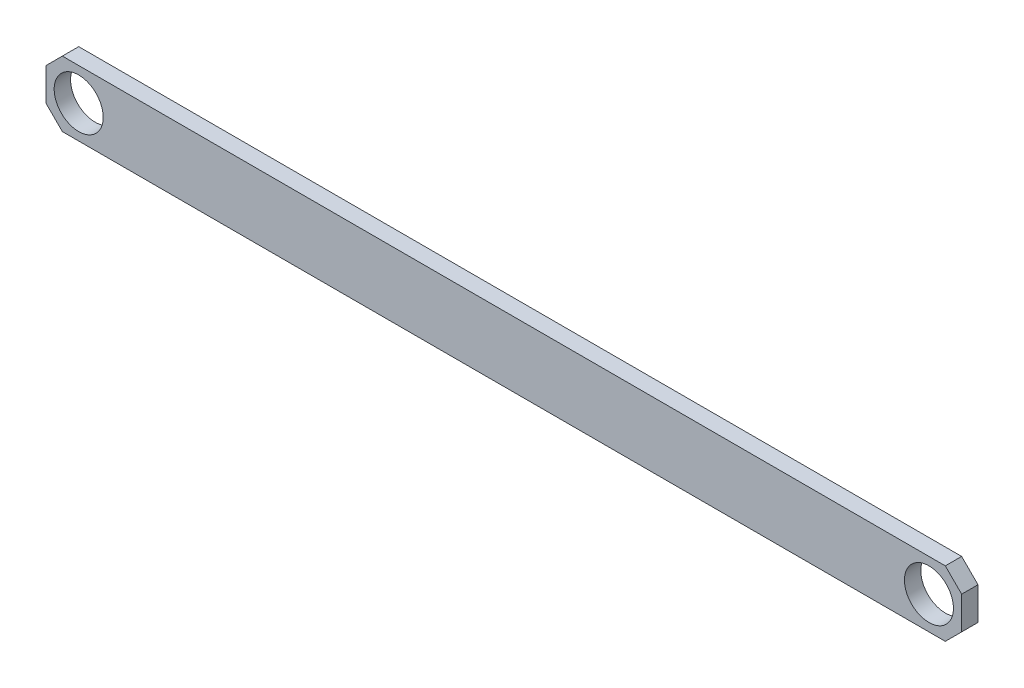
ISO-10303-21;
HEADER;
FILE_DESCRIPTION(('STEP AP214'),'2;1');
FILE_NAME('part.step','',(''),(''),'','','');
FILE_SCHEMA(('AUTOMOTIVE_DESIGN { 1 0 10303 214 1 1 1 1 }'));
ENDSEC;
DATA;
#1=APPLICATION_CONTEXT('core data for automotive mechanical design processes');
#2=APPLICATION_PROTOCOL_DEFINITION('international standard','automotive_design',2000,#1);
#3=PRODUCT_CONTEXT('',#1,'mechanical');
#4=PRODUCT('Part','Part','',(#3));
#5=PRODUCT_RELATED_PRODUCT_CATEGORY('part','',(#4));
#6=PRODUCT_DEFINITION_FORMATION('','',#4);
#7=PRODUCT_DEFINITION_CONTEXT('part definition',#1,'design');
#8=PRODUCT_DEFINITION('design','',#6,#7);
#9=PRODUCT_DEFINITION_SHAPE('','',#8);
#10=(LENGTH_UNIT() NAMED_UNIT(*) SI_UNIT(.MILLI.,.METRE.));
#11=(NAMED_UNIT(*) PLANE_ANGLE_UNIT() SI_UNIT($,.RADIAN.));
#12=(NAMED_UNIT(*) SI_UNIT($,.STERADIAN.) SOLID_ANGLE_UNIT());
#13=UNCERTAINTY_MEASURE_WITH_UNIT(LENGTH_MEASURE(1.E-05),#10,'distance_accuracy_value','');
#14=(GEOMETRIC_REPRESENTATION_CONTEXT(3) GLOBAL_UNCERTAINTY_ASSIGNED_CONTEXT((#13)) GLOBAL_UNIT_ASSIGNED_CONTEXT((#10,
#11,#12)) REPRESENTATION_CONTEXT('',''));
#15=CARTESIAN_POINT('',(0.,0.,0.));
#16=DIRECTION('',(0.,0.,1.));
#17=DIRECTION('',(1.,0.,0.));
#18=AXIS2_PLACEMENT_3D('',#15,#16,#17);
#19=CARTESIAN_POINT('',(0.,12.7,3.175));
#20=DIRECTION('',(0.,0.,-1.));
#21=DIRECTION('',(-1.,0.,0.));
#22=AXIS2_PLACEMENT_3D('',#19,#20,#21);
#23=PLANE('',#22);
#24=CARTESIAN_POINT('',(6.35,6.35,3.175));
#25=DIRECTION('',(0.,0.,1.));
#26=DIRECTION('',(1.,0.,0.));
#27=AXIS2_PLACEMENT_3D('',#24,#25,#26);
#28=CIRCLE('',#27,4.7625);
#29=CARTESIAN_POINT('',(11.1125,6.35,3.175));
#30=VERTEX_POINT('',#29);
#31=EDGE_CURVE('E125',#30,#30,#28,.T.);
#32=ORIENTED_EDGE('',*,*,#31,.F.);
#33=EDGE_LOOP('',(#32));
#34=FACE_BOUND('',#33,.T.);
#35=DIRECTION('',(-1.,0.,0.));
#36=VECTOR('',#35,1.);
#37=CARTESIAN_POINT('',(0.,12.7,3.175));
#38=LINE('',#37,#36);
#39=CARTESIAN_POINT('',(174.625,12.7,3.175));
#40=VERTEX_POINT('',#39);
#41=CARTESIAN_POINT('',(3.17500000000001,12.7,3.175));
#42=VERTEX_POINT('',#41);
#43=EDGE_CURVE('E143',#40,#42,#38,.T.);
#44=ORIENTED_EDGE('',*,*,#43,.T.);
#45=DIRECTION('',(0.707106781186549,0.707106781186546,0.));
#46=VECTOR('',#45,1.);
#47=CARTESIAN_POINT('',(0.,9.525,3.175));
#48=LINE('',#47,#46);
#49=CARTESIAN_POINT('',(0.,9.525,3.175));
#50=VERTEX_POINT('',#49);
#51=EDGE_CURVE('E159',#42,#50,#48,.F.);
#52=ORIENTED_EDGE('',*,*,#51,.T.);
#53=DIRECTION('',(0.,-1.,0.));
#54=VECTOR('',#53,1.);
#55=CARTESIAN_POINT('',(0.,0.,3.175));
#56=LINE('',#55,#54);
#57=CARTESIAN_POINT('',(0.,3.17500000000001,3.175));
#58=VERTEX_POINT('',#57);
#59=EDGE_CURVE('E117',#50,#58,#56,.T.);
#60=ORIENTED_EDGE('',*,*,#59,.T.);
#61=DIRECTION('',(-0.707106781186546,0.707106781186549,0.));
#62=VECTOR('',#61,1.);
#63=CARTESIAN_POINT('',(3.175,0.,3.175));
#64=LINE('',#63,#62);
#65=CARTESIAN_POINT('',(3.175,0.,3.175));
#66=VERTEX_POINT('',#65);
#67=EDGE_CURVE('E157',#58,#66,#64,.F.);
#68=ORIENTED_EDGE('',*,*,#67,.T.);
#69=DIRECTION('',(1.,0.,0.));
#70=VECTOR('',#69,1.);
#71=CARTESIAN_POINT('',(0.,0.,3.175));
#72=LINE('',#71,#70);
#73=CARTESIAN_POINT('',(174.625,0.,3.175));
#74=VERTEX_POINT('',#73);
#75=EDGE_CURVE('E139',#66,#74,#72,.T.);
#76=ORIENTED_EDGE('',*,*,#75,.T.);
#77=DIRECTION('',(-0.707106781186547,-0.707106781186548,0.));
#78=VECTOR('',#77,1.);
#79=CARTESIAN_POINT('',(177.8,3.17500000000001,3.175));
#80=LINE('',#79,#78);
#81=CARTESIAN_POINT('',(177.8,3.17500000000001,3.175));
#82=VERTEX_POINT('',#81);
#83=EDGE_CURVE('E53',#74,#82,#80,.F.);
#84=ORIENTED_EDGE('',*,*,#83,.T.);
#85=DIRECTION('',(0.,1.,0.));
#86=VECTOR('',#85,1.);
#87=CARTESIAN_POINT('',(177.8,0.,3.175));
#88=LINE('',#87,#86);
#89=CARTESIAN_POINT('',(177.8,9.525,3.175));
#90=VERTEX_POINT('',#89);
#91=EDGE_CURVE('E141',#82,#90,#88,.T.);
#92=ORIENTED_EDGE('',*,*,#91,.T.);
#93=DIRECTION('',(0.707106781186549,-0.707106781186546,0.));
#94=VECTOR('',#93,1.);
#95=CARTESIAN_POINT('',(174.625,12.7,3.175));
#96=LINE('',#95,#94);
#97=EDGE_CURVE('E154',#90,#40,#96,.F.);
#98=ORIENTED_EDGE('',*,*,#97,.T.);
#99=EDGE_LOOP('',(#44,#52,#60,#68,#76,#84,#92,#98));
#100=FACE_BOUND('',#99,.T.);
#101=CARTESIAN_POINT('',(171.45,6.35,3.175));
#102=DIRECTION('',(0.,0.,1.));
#103=DIRECTION('',(-1.,0.,0.));
#104=AXIS2_PLACEMENT_3D('',#101,#102,#103);
#105=CIRCLE('',#104,4.76249999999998);
#106=CARTESIAN_POINT('',(166.6875,6.35,3.175));
#107=VERTEX_POINT('',#106);
#108=EDGE_CURVE('E290',#107,#107,#105,.T.);
#109=ORIENTED_EDGE('',*,*,#108,.F.);
#110=EDGE_LOOP('',(#109));
#111=FACE_BOUND('',#110,.T.);
#112=ADVANCED_FACE('F32',(#34,#100,#111),#23,.F.);
#113=CARTESIAN_POINT('',(0.,12.7,0.));
#114=DIRECTION('',(0.,0.,-1.));
#115=DIRECTION('',(-1.,0.,0.));
#116=AXIS2_PLACEMENT_3D('',#113,#114,#115);
#117=PLANE('',#116);
#118=CARTESIAN_POINT('',(6.35,6.35,0.));
#119=DIRECTION('',(0.,0.,1.));
#120=DIRECTION('',(1.,0.,0.));
#121=AXIS2_PLACEMENT_3D('',#118,#119,#120);
#122=CIRCLE('',#121,4.7625);
#123=CARTESIAN_POINT('',(11.1125,6.35,0.));
#124=VERTEX_POINT('',#123);
#125=EDGE_CURVE('E131',#124,#124,#122,.T.);
#126=ORIENTED_EDGE('',*,*,#125,.T.);
#127=EDGE_LOOP('',(#126));
#128=FACE_BOUND('',#127,.T.);
#129=DIRECTION('',(0.,-1.,0.));
#130=VECTOR('',#129,1.);
#131=CARTESIAN_POINT('',(0.,0.,0.));
#132=LINE('',#131,#130);
#133=CARTESIAN_POINT('',(0.,9.525,0.));
#134=VERTEX_POINT('',#133);
#135=CARTESIAN_POINT('',(0.,3.17500000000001,0.));
#136=VERTEX_POINT('',#135);
#137=EDGE_CURVE('E114',#134,#136,#132,.T.);
#138=ORIENTED_EDGE('',*,*,#137,.F.);
#139=DIRECTION('',(-0.707106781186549,-0.707106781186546,0.));
#140=VECTOR('',#139,1.);
#141=CARTESIAN_POINT('',(1.5875,11.1125,0.));
#142=LINE('',#141,#140);
#143=CARTESIAN_POINT('',(3.17500000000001,12.7,0.));
#144=VERTEX_POINT('',#143);
#145=EDGE_CURVE('E98',#134,#144,#142,.F.);
#146=ORIENTED_EDGE('',*,*,#145,.T.);
#147=DIRECTION('',(-1.,0.,0.));
#148=VECTOR('',#147,1.);
#149=CARTESIAN_POINT('',(0.,12.7,0.));
#150=LINE('',#149,#148);
#151=CARTESIAN_POINT('',(174.625,12.7,0.));
#152=VERTEX_POINT('',#151);
#153=EDGE_CURVE('E136',#152,#144,#150,.T.);
#154=ORIENTED_EDGE('',*,*,#153,.F.);
#155=DIRECTION('',(-0.707106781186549,0.707106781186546,0.));
#156=VECTOR('',#155,1.);
#157=CARTESIAN_POINT('',(87.3124999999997,100.0125,0.));
#158=LINE('',#157,#156);
#159=CARTESIAN_POINT('',(177.8,9.525,0.));
#160=VERTEX_POINT('',#159);
#161=EDGE_CURVE('E118',#152,#160,#158,.F.);
#162=ORIENTED_EDGE('',*,*,#161,.T.);
#163=DIRECTION('',(0.,1.,0.));
#164=VECTOR('',#163,1.);
#165=CARTESIAN_POINT('',(177.8,0.,0.));
#166=LINE('',#165,#164);
#167=CARTESIAN_POINT('',(177.8,3.17500000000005,0.));
#168=VERTEX_POINT('',#167);
#169=EDGE_CURVE('E128',#168,#160,#166,.T.);
#170=ORIENTED_EDGE('',*,*,#169,.F.);
#171=DIRECTION('',(0.707106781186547,0.707106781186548,0.));
#172=VECTOR('',#171,1.);
#173=CARTESIAN_POINT('',(93.6625,-80.9625,0.));
#174=LINE('',#173,#172);
#175=CARTESIAN_POINT('',(174.625,0.,0.));
#176=VERTEX_POINT('',#175);
#177=EDGE_CURVE('E148',#168,#176,#174,.F.);
#178=ORIENTED_EDGE('',*,*,#177,.T.);
#179=DIRECTION('',(1.,0.,0.));
#180=VECTOR('',#179,1.);
#181=CARTESIAN_POINT('',(0.,0.,0.));
#182=LINE('',#181,#180);
#183=CARTESIAN_POINT('',(3.175,0.,0.));
#184=VERTEX_POINT('',#183);
#185=EDGE_CURVE('E124',#184,#176,#182,.T.);
#186=ORIENTED_EDGE('',*,*,#185,.F.);
#187=DIRECTION('',(0.707106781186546,-0.707106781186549,0.));
#188=VECTOR('',#187,1.);
#189=CARTESIAN_POINT('',(-4.76249999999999,7.93750000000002,0.));
#190=LINE('',#189,#188);
#191=EDGE_CURVE('E109',#184,#136,#190,.F.);
#192=ORIENTED_EDGE('',*,*,#191,.T.);
#193=EDGE_LOOP('',(#138,#146,#154,#162,#170,#178,#186,#192));
#194=FACE_BOUND('',#193,.T.);
#195=CARTESIAN_POINT('',(171.45,6.35,0.));
#196=DIRECTION('',(0.,0.,1.));
#197=DIRECTION('',(-1.,0.,0.));
#198=AXIS2_PLACEMENT_3D('',#195,#196,#197);
#199=CIRCLE('',#198,4.76249999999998);
#200=CARTESIAN_POINT('',(166.6875,6.35,0.));
#201=VERTEX_POINT('',#200);
#202=EDGE_CURVE('E292',#201,#201,#199,.T.);
#203=ORIENTED_EDGE('',*,*,#202,.T.);
#204=EDGE_LOOP('',(#203));
#205=FACE_BOUND('',#204,.T.);
#206=ADVANCED_FACE('F121',(#128,#194,#205),#117,.T.);
#207=CARTESIAN_POINT('',(0.,0.,3.175));
#208=DIRECTION('',(1.,0.,0.));
#209=DIRECTION('',(0.,0.,-1.));
#210=AXIS2_PLACEMENT_3D('',#207,#208,#209);
#211=PLANE('',#210);
#212=ORIENTED_EDGE('',*,*,#59,.F.);
#213=DIRECTION('',(0.,0.,-1.));
#214=VECTOR('',#213,1.);
#215=CARTESIAN_POINT('',(0.,9.525,3.175));
#216=LINE('',#215,#214);
#217=EDGE_CURVE('E102',#50,#134,#216,.T.);
#218=ORIENTED_EDGE('',*,*,#217,.T.);
#219=ORIENTED_EDGE('',*,*,#137,.T.);
#220=DIRECTION('',(0.,0.,1.));
#221=VECTOR('',#220,1.);
#222=CARTESIAN_POINT('',(0.,3.17500000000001,3.175));
#223=LINE('',#222,#221);
#224=EDGE_CURVE('E119',#136,#58,#223,.T.);
#225=ORIENTED_EDGE('',*,*,#224,.T.);
#226=EDGE_LOOP('',(#212,#218,#219,#225));
#227=FACE_BOUND('',#226,.T.);
#228=ADVANCED_FACE('F34',(#227),#211,.F.);
#229=CARTESIAN_POINT('',(0.,0.,3.175));
#230=DIRECTION('',(0.,1.,0.));
#231=DIRECTION('',(0.,0.,1.));
#232=AXIS2_PLACEMENT_3D('',#229,#230,#231);
#233=PLANE('',#232);
#234=ORIENTED_EDGE('',*,*,#75,.F.);
#235=DIRECTION('',(0.,0.,-1.));
#236=VECTOR('',#235,1.);
#237=CARTESIAN_POINT('',(3.175,0.,3.175));
#238=LINE('',#237,#236);
#239=EDGE_CURVE('E163',#66,#184,#238,.T.);
#240=ORIENTED_EDGE('',*,*,#239,.T.);
#241=ORIENTED_EDGE('',*,*,#185,.T.);
#242=DIRECTION('',(0.,0.,1.));
#243=VECTOR('',#242,1.);
#244=CARTESIAN_POINT('',(174.625,0.,3.175));
#245=LINE('',#244,#243);
#246=EDGE_CURVE('E161',#176,#74,#245,.T.);
#247=ORIENTED_EDGE('',*,*,#246,.T.);
#248=EDGE_LOOP('',(#234,#240,#241,#247));
#249=FACE_BOUND('',#248,.T.);
#250=ADVANCED_FACE('F168',(#249),#233,.F.);
#251=CARTESIAN_POINT('',(177.8,0.,3.175));
#252=DIRECTION('',(-1.,0.,0.));
#253=DIRECTION('',(0.,0.,1.));
#254=AXIS2_PLACEMENT_3D('',#251,#252,#253);
#255=PLANE('',#254);
#256=ORIENTED_EDGE('',*,*,#91,.F.);
#257=DIRECTION('',(0.,0.,-1.));
#258=VECTOR('',#257,1.);
#259=CARTESIAN_POINT('',(177.8,3.17500000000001,3.175));
#260=LINE('',#259,#258);
#261=EDGE_CURVE('E11',#82,#168,#260,.T.);
#262=ORIENTED_EDGE('',*,*,#261,.T.);
#263=ORIENTED_EDGE('',*,*,#169,.T.);
#264=DIRECTION('',(0.,0.,1.));
#265=VECTOR('',#264,1.);
#266=CARTESIAN_POINT('',(177.8,9.525,3.175));
#267=LINE('',#266,#265);
#268=EDGE_CURVE('E40',#160,#90,#267,.T.);
#269=ORIENTED_EDGE('',*,*,#268,.T.);
#270=EDGE_LOOP('',(#256,#262,#263,#269));
#271=FACE_BOUND('',#270,.T.);
#272=ADVANCED_FACE('F176',(#271),#255,.F.);
#273=CARTESIAN_POINT('',(0.,12.7,3.175));
#274=DIRECTION('',(0.,-1.,0.));
#275=DIRECTION('',(0.,0.,-1.));
#276=AXIS2_PLACEMENT_3D('',#273,#274,#275);
#277=PLANE('',#276);
#278=ORIENTED_EDGE('',*,*,#153,.T.);
#279=DIRECTION('',(0.,0.,1.));
#280=VECTOR('',#279,1.);
#281=CARTESIAN_POINT('',(3.17500000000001,12.7,3.175));
#282=LINE('',#281,#280);
#283=EDGE_CURVE('E103',#144,#42,#282,.T.);
#284=ORIENTED_EDGE('',*,*,#283,.T.);
#285=ORIENTED_EDGE('',*,*,#43,.F.);
#286=DIRECTION('',(0.,0.,-1.));
#287=VECTOR('',#286,1.);
#288=CARTESIAN_POINT('',(174.625,12.7,3.175));
#289=LINE('',#288,#287);
#290=EDGE_CURVE('E108',#40,#152,#289,.T.);
#291=ORIENTED_EDGE('',*,*,#290,.T.);
#292=EDGE_LOOP('',(#278,#284,#285,#291));
#293=FACE_BOUND('',#292,.T.);
#294=ADVANCED_FACE('F184',(#293),#277,.F.);
#295=CARTESIAN_POINT('',(6.35,6.35,3.175));
#296=DIRECTION('',(0.,0.,-1.));
#297=DIRECTION('',(-1.,0.,0.));
#298=AXIS2_PLACEMENT_3D('',#295,#296,#297);
#299=CYLINDRICAL_SURFACE('',#298,4.7625);
#300=ORIENTED_EDGE('',*,*,#31,.T.);
#301=EDGE_LOOP('',(#300));
#302=FACE_BOUND('',#301,.T.);
#303=ORIENTED_EDGE('',*,*,#125,.F.);
#304=EDGE_LOOP('',(#303));
#305=FACE_BOUND('',#304,.T.);
#306=ADVANCED_FACE('F208',(#302,#305),#299,.F.);
#307=CARTESIAN_POINT('',(171.45,6.35,3.175));
#308=DIRECTION('',(0.,0.,-1.));
#309=DIRECTION('',(-1.,0.,0.));
#310=AXIS2_PLACEMENT_3D('',#307,#308,#309);
#311=CYLINDRICAL_SURFACE('',#310,4.76249999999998);
#312=ORIENTED_EDGE('',*,*,#108,.T.);
#313=EDGE_LOOP('',(#312));
#314=FACE_BOUND('',#313,.T.);
#315=ORIENTED_EDGE('',*,*,#202,.F.);
#316=EDGE_LOOP('',(#315));
#317=FACE_BOUND('',#316,.T.);
#318=ADVANCED_FACE('F193',(#314,#317),#311,.F.);
#319=CARTESIAN_POINT('',(0.,9.525,3.175));
#320=DIRECTION('',(0.707106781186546,-0.707106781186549,0.));
#321=DIRECTION('',(0.707106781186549,0.707106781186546,0.));
#322=AXIS2_PLACEMENT_3D('',#319,#320,#321);
#323=PLANE('',#322);
#324=ORIENTED_EDGE('',*,*,#51,.F.);
#325=ORIENTED_EDGE('',*,*,#283,.F.);
#326=ORIENTED_EDGE('',*,*,#145,.F.);
#327=ORIENTED_EDGE('',*,*,#217,.F.);
#328=EDGE_LOOP('',(#324,#325,#326,#327));
#329=FACE_BOUND('',#328,.T.);
#330=ADVANCED_FACE('F101',(#329),#323,.F.);
#331=CARTESIAN_POINT('',(3.175,0.,3.175));
#332=DIRECTION('',(0.707106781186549,0.707106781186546,0.));
#333=DIRECTION('',(-0.707106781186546,0.707106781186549,0.));
#334=AXIS2_PLACEMENT_3D('',#331,#332,#333);
#335=PLANE('',#334);
#336=ORIENTED_EDGE('',*,*,#67,.F.);
#337=ORIENTED_EDGE('',*,*,#224,.F.);
#338=ORIENTED_EDGE('',*,*,#191,.F.);
#339=ORIENTED_EDGE('',*,*,#239,.F.);
#340=EDGE_LOOP('',(#336,#337,#338,#339));
#341=FACE_BOUND('',#340,.T.);
#342=ADVANCED_FACE('F185',(#341),#335,.F.);
#343=CARTESIAN_POINT('',(177.8,3.17500000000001,3.175));
#344=DIRECTION('',(-0.707106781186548,0.707106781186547,0.));
#345=DIRECTION('',(-0.707106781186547,-0.707106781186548,0.));
#346=AXIS2_PLACEMENT_3D('',#343,#344,#345);
#347=PLANE('',#346);
#348=ORIENTED_EDGE('',*,*,#83,.F.);
#349=ORIENTED_EDGE('',*,*,#246,.F.);
#350=ORIENTED_EDGE('',*,*,#177,.F.);
#351=ORIENTED_EDGE('',*,*,#261,.F.);
#352=EDGE_LOOP('',(#348,#349,#350,#351));
#353=FACE_BOUND('',#352,.T.);
#354=ADVANCED_FACE('F175',(#353),#347,.F.);
#355=CARTESIAN_POINT('',(174.625,12.7,3.175));
#356=DIRECTION('',(-0.707106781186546,-0.707106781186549,0.));
#357=DIRECTION('',(0.707106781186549,-0.707106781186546,0.));
#358=AXIS2_PLACEMENT_3D('',#355,#356,#357);
#359=PLANE('',#358);
#360=ORIENTED_EDGE('',*,*,#97,.F.);
#361=ORIENTED_EDGE('',*,*,#268,.F.);
#362=ORIENTED_EDGE('',*,*,#161,.F.);
#363=ORIENTED_EDGE('',*,*,#290,.F.);
#364=EDGE_LOOP('',(#360,#361,#362,#363));
#365=FACE_BOUND('',#364,.T.);
#366=ADVANCED_FACE('F182',(#365),#359,.F.);
#367=CLOSED_SHELL('',(#112,#206,#228,#250,#272,#294,#306,#318,#330,#342,#354,#366));
#368=MANIFOLD_SOLID_BREP('B2',#367);
#369=ADVANCED_BREP_SHAPE_REPRESENTATION('',(#18,#368),#14);
#370=SHAPE_DEFINITION_REPRESENTATION(#9,#369);
ENDSEC;
END-ISO-10303-21;
